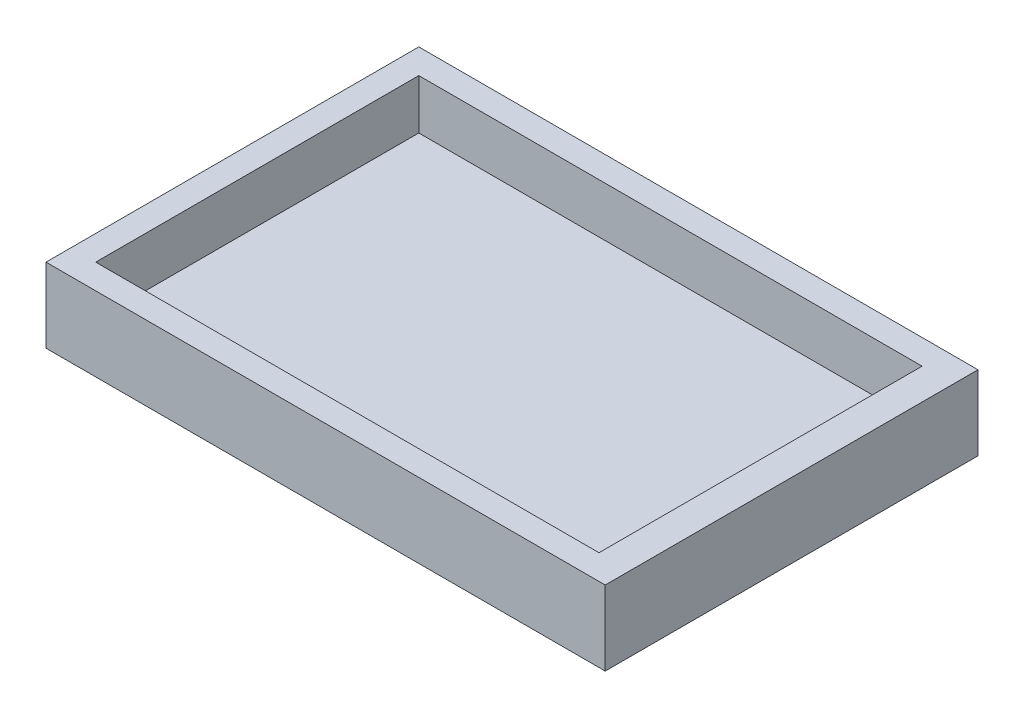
from build123d import *

# Parameters (mm, degrees)
SKETCH1_W               = 225
SKETCH1_H               = 150
BOSS_EXTRUDE1_DEPTH     = 30
CUT_EXTRUDE1_DEPTH      = 20
CUT_EXTRUDE1_DEPTH_BACK = 20
SKETCH2_W               = 202.5
SKETCH2_H               = 130


with BuildPart() as part:
    # Sketch1 → Boss-Extrude1 (new body)
    with BuildSketch(Plane(origin=(0, 0, 0), x_dir=(1, 0, 0), z_dir=(0, 1, 0))):
        with Locations((112.5, -75)):
            Rectangle(SKETCH1_W, SKETCH1_H)
    extrude(amount=BOSS_EXTRUDE1_DEPTH)

    # Sketch2 → Cut-Extrude1 (cut, two sides: drawn at the far end of the back side and taken through both)
    with BuildSketch(Plane(origin=(0, 30, 0), x_dir=(1, 0, 0), z_dir=(0, 1, 0)).offset(-CUT_EXTRUDE1_DEPTH_BACK)):
        with Locations((111.25, -75)):
            Rectangle(SKETCH2_W, SKETCH2_H)
    extrude(amount=CUT_EXTRUDE1_DEPTH + CUT_EXTRUDE1_DEPTH_BACK, mode=Mode.SUBTRACT)


solid = part.part
